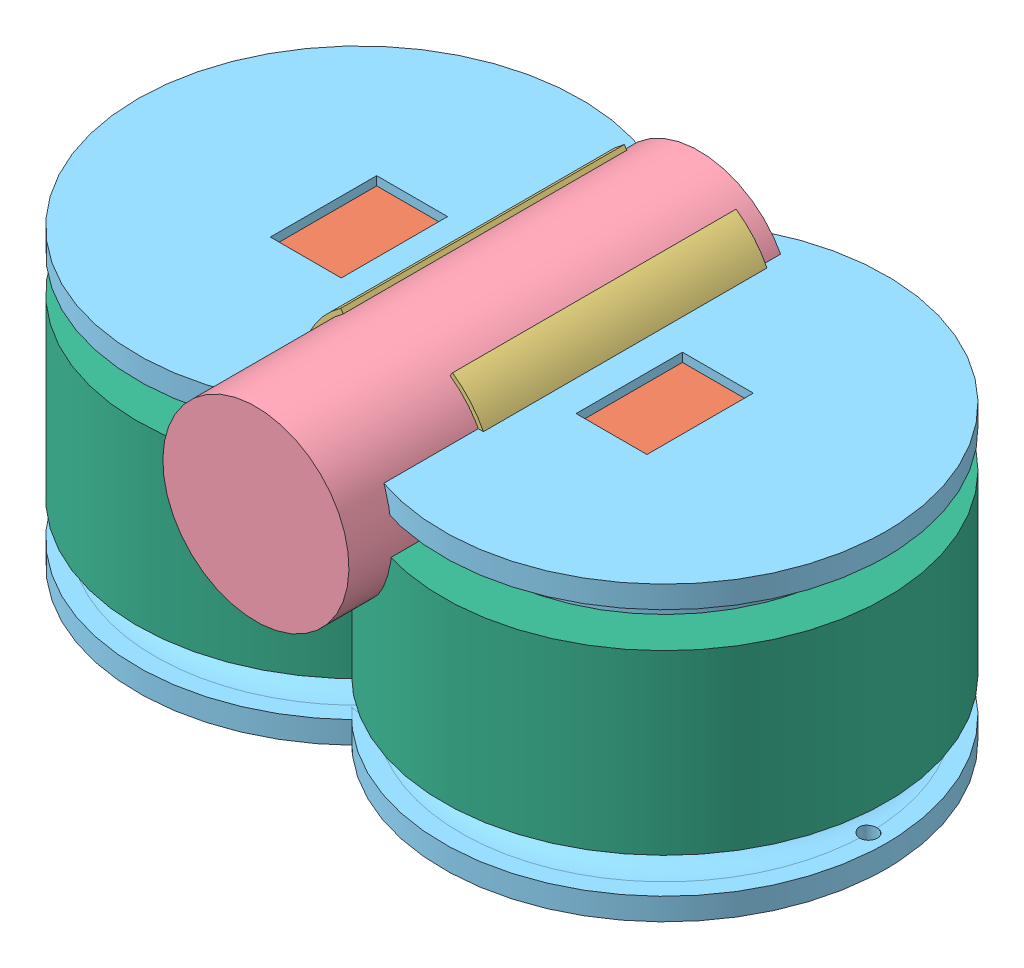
SolidWorks assembly Ensamblaje-CM-CAE.SLDASM, configuration Predeterminado (file format 12000). Lengths in mm.
Overall size (99.54 46.75 67.27).
9 component instances, 6 part files, 23 mates.
Components (placement in the parent):
- core-1: core.SLDPRT [Predeterminado] at (45.3169 0.4662 52.584) size (42.5 32 12)
- core2-1: core2.SLDPRT [Predeterminado] at (66.5669 24.4662 52.584) size (42.5 8 12)
- circular2-1: circular2.SLDPRT [Predeterminado] at (45.3169 28.4662 39.584) x (0.421854 -0.906664 0) z (0 0 1) size (16.51 11 32)
- circular2-2: circular2.SLDPRT [Predeterminado] at (45.3169 28.4662 39.584) x (-0.573576 0.819152 0) z (0 0 1) size (16.51 11 32)
- fluido-1: fluido.SLDPRT [Predeterminado] at (45.3169 28.4662 37.4673) x (0.999713 -0.023948 0) z (0 0 1) size (21 21 50)
- carrete cuadrado-1: carrete cuadrado.SLDPRT [Predeterminado] at (28.0669 0.4662 58.584) x (1 0 0) z (0 1 0) size (50 50 33)
- carrete cuadrado-2: carrete cuadrado.SLDPRT [Predeterminado] at (62.5669 0.4662 58.584) x (1 0 0) z (0 1 0) size (50 50 33)
- embobinado-1: embobinado.SLDPRT [Predeterminado] at (28.0669 6.9662 58.584) x (-0.454994 0 -0.890495) z (0.890495 0 -0.454994) size (50 20 50)
- embobinado-2: embobinado.SLDPRT [Predeterminado] at (62.5669 6.9662 58.584) x (0.302906 0 -0.953021) z (0.953021 0 0.302906) size (50 20 50)
Mates (geometry in assembly coordinates):
- Coincidente1: coincident aligned: plane of core-1 through (66.5669 -7.5338 64.584) normal (1 0 0); plane of core2-1 through (66.5669 24.4662 64.584) normal (1 0 0)
- Coincidente2: coincident anti-aligned: plane of core-1 through (66.5669 24.4662 64.584) normal (0 1 0); plane of core2-1 through (66.5669 24.4662 64.584) normal (0 -1 0)
- Coincidente3: coincident aligned: plane of core-1 through (45.3169 0.4662 64.584) normal (0 0 1); plane of core2-1 through (66.5669 24.4662 64.584) normal (0 0 1)
- Concéntrica1: concentric anti-aligned: cylinder of core2-1 through (45.3169 28.4662 52.584) axis (0 0 1) radius 11; cylinder of circular2-1 through (45.3169 28.4662 71.584) axis (0 0 -1) radius 11
- Paralelo1: parallel aligned: plane of core2-1 through (66.5669 24.4662 64.584) normal (0 0 1); plane of circular2-1 through (45.3169 28.4662 71.584) normal (0 0 1)
- Concéntrica2: concentric anti-aligned: cylinder of core2-1 through (45.3169 28.4662 52.584) axis (0 0 1) radius 11; cylinder of circular2-2 through (45.3169 28.4662 71.584) axis (0 0 -1) radius 11
- Paralelo2: parallel aligned: plane of core2-1 through (66.5669 24.4662 64.584) normal (0 0 1); plane of circular2-2 through (45.3169 28.4662 71.584) normal (0 0 1)
- Paralelo3: parallel aligned: plane of circular2-1 through (45.3169 28.4662 71.584) normal (0 0 1); plane of circular2-2 through (45.3169 28.4662 71.584) normal (0 0 1)
- Coincidente4: coincident aligned: plane of circular2-1 through (45.3169 28.4662 71.584) normal (0 0 1); plane of circular2-2 through (45.3169 28.4662 71.584) normal (0 0 1)
- Distancia1: distance = 7 mm aligned: plane of circular2-2 through (45.3169 28.4662 71.584) normal (0 0 1); plane of core2-1 through (66.5669 24.4662 64.584) normal (0 0 1)
- Ángulo2: planar angle = 1.22173 rad anti-aligned: plane of circular2-1 through (45.3169 28.4662 71.584) normal (-0.819152 0.573576 0); plane of circular2-2 through (45.3169 28.4662 71.584) normal (0.819152 0.573576 0)
- Ángulo3: planar angle = 0.959931 rad aligned: plane of circular2-2 through (45.3169 28.4662 71.584) normal (0.819152 0.573576 0); plane of core2-1 through (66.5669 32.4662 64.584) normal (0 1 0)
- Concéntrica3: concentric aligned: cylinder of circular2-2 through (45.3169 28.4662 71.584) axis (0 0 -1) radius 10.5; cylinder of fluido-1 through (45.3169 28.4662 87.4673) axis (0 0 -1) radius 10.5
- Coincidente5: coincident anti-aligned: plane of core-1 through (58.5669 0.4662 64.584) normal (0 1 0); plane of carrete cuadrado-1 through (28.0669 0.4662 58.584) normal (0 -1 0)
- Coincidente6: coincident anti-aligned: plane of core-1 through (45.3169 0.4662 52.584) normal (0 0 -1); plane of carrete cuadrado-2 through (58.5669 2.9662 52.584) normal (0 0 1)
- Coincidente7: coincident anti-aligned: plane of core-1 through (58.5669 0.4662 64.584) normal (0 1 0); plane of carrete cuadrado-2 through (62.5669 0.4662 58.584) normal (0 -1 0)
- Coincidente8: coincident anti-aligned: plane of core-1 through (66.5669 -7.5338 64.584) normal (1 0 0); plane of carrete cuadrado-2 through (66.5669 2.9662 52.584) normal (-1 0 0)
- Coincidente9: coincident anti-aligned: plane of core-1 through (24.0669 24.4662 64.584) normal (-1 0 0); plane of carrete cuadrado-1 through (24.0669 2.9662 52.584) normal (1 0 0)
- Coincidente10: coincident anti-aligned: plane of core-1 through (45.3169 0.4662 52.584) normal (0 0 -1); plane of carrete cuadrado-1 through (24.0669 2.9662 52.584) normal (0 0 1)
- Concéntrica5: concentric aligned: cylinder of carrete cuadrado-1 through (28.0669 30.9662 58.584) axis (0 -1 0) radius 19; cylinder of embobinado-1 through (28.0669 26.9662 58.584) axis (0 -1 0) radius 20
- Distancia2: distance = 4 mm anti-aligned: plane of carrete cuadrado-1 through (28.0669 30.9662 58.584) normal (0 -1 0); plane of embobinado-1 through (28.0669 26.9662 58.584) normal (0 1 0)
- Concéntrica6: concentric aligned: cylinder of carrete cuadrado-2 through (62.5669 30.9662 58.584) axis (0 -1 0) radius 19; cylinder of embobinado-2 through (62.5669 26.9662 58.584) axis (0 -1 0) radius 20
- Distancia4: distance = 4 mm anti-aligned: plane of carrete cuadrado-2 through (62.5669 30.9662 58.584) normal (0 -1 0); plane of embobinado-2 through (62.5669 26.9662 58.584) normal (0 1 0)
